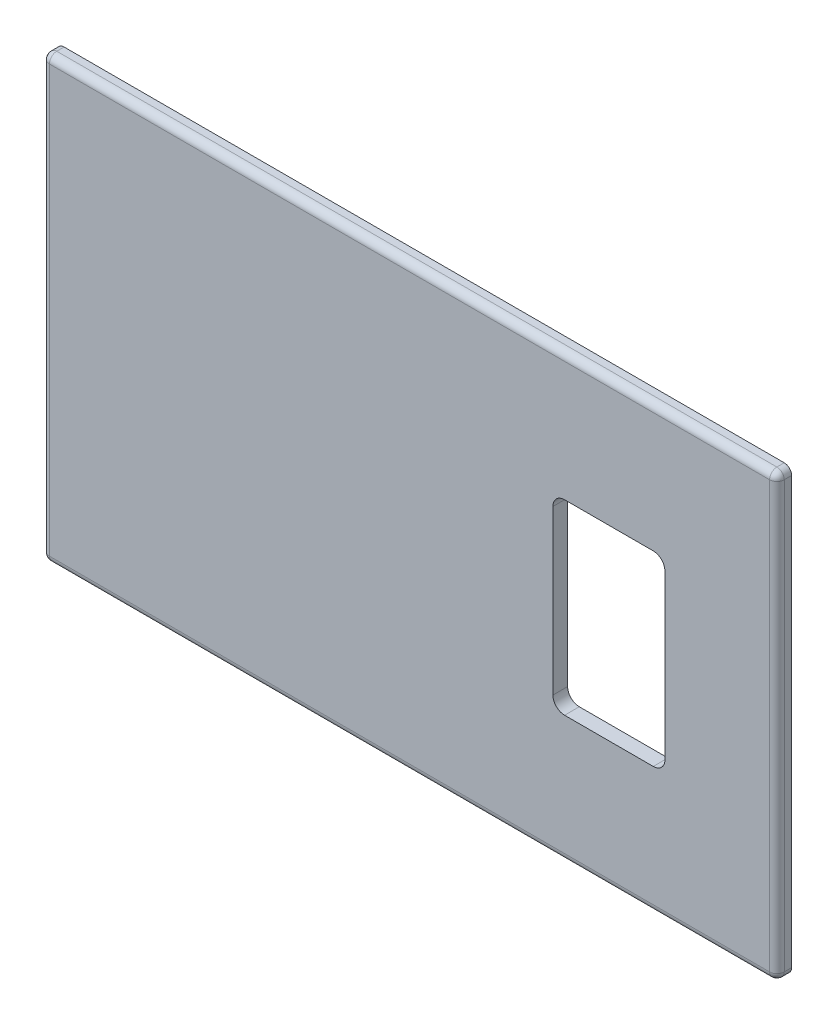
ISO-10303-21;
HEADER;
FILE_DESCRIPTION(('STEP AP214'),'2;1');
FILE_NAME('part.step','',(''),(''),'','','');
FILE_SCHEMA(('AUTOMOTIVE_DESIGN { 1 0 10303 214 1 1 1 1 }'));
ENDSEC;
DATA;
#1=APPLICATION_CONTEXT('core data for automotive mechanical design processes');
#2=APPLICATION_PROTOCOL_DEFINITION('international standard','automotive_design',2000,#1);
#3=PRODUCT_CONTEXT('',#1,'mechanical');
#4=PRODUCT('Part','Part','',(#3));
#5=PRODUCT_RELATED_PRODUCT_CATEGORY('part','',(#4));
#6=PRODUCT_DEFINITION_FORMATION('','',#4);
#7=PRODUCT_DEFINITION_CONTEXT('part definition',#1,'design');
#8=PRODUCT_DEFINITION('design','',#6,#7);
#9=PRODUCT_DEFINITION_SHAPE('','',#8);
#10=(LENGTH_UNIT() NAMED_UNIT(*) SI_UNIT(.MILLI.,.METRE.));
#11=(NAMED_UNIT(*) PLANE_ANGLE_UNIT() SI_UNIT($,.RADIAN.));
#12=(NAMED_UNIT(*) SI_UNIT($,.STERADIAN.) SOLID_ANGLE_UNIT());
#13=UNCERTAINTY_MEASURE_WITH_UNIT(LENGTH_MEASURE(1.E-05),#10,'distance_accuracy_value','');
#14=(GEOMETRIC_REPRESENTATION_CONTEXT(3) GLOBAL_UNCERTAINTY_ASSIGNED_CONTEXT((#13)) GLOBAL_UNIT_ASSIGNED_CONTEXT((#10,
#11,#12)) REPRESENTATION_CONTEXT('',''));
#15=CARTESIAN_POINT('',(0.,0.,0.));
#16=DIRECTION('',(0.,0.,1.));
#17=DIRECTION('',(1.,0.,0.));
#18=AXIS2_PLACEMENT_3D('',#15,#16,#17);
#19=CARTESIAN_POINT('',(-50.,-30.,2.));
#20=DIRECTION('',(0.,1.,0.));
#21=DIRECTION('',(0.,0.,1.));
#22=AXIS2_PLACEMENT_3D('',#19,#20,#21);
#23=PLANE('',#22);
#24=DIRECTION('',(1.,0.,0.));
#25=VECTOR('',#24,1.);
#26=CARTESIAN_POINT('',(-50.,-30.,0.));
#27=LINE('',#26,#25);
#28=CARTESIAN_POINT('',(-49.,-30.,0.));
#29=VERTEX_POINT('',#28);
#30=CARTESIAN_POINT('',(49.,-30.,0.));
#31=VERTEX_POINT('',#30);
#32=EDGE_CURVE('E264',#29,#31,#27,.T.);
#33=ORIENTED_EDGE('',*,*,#32,.T.);
#34=DIRECTION('',(0.,0.,-1.));
#35=VECTOR('',#34,1.);
#36=CARTESIAN_POINT('',(49.,-30.,2.));
#37=LINE('',#36,#35);
#38=CARTESIAN_POINT('',(49.,-30.,1.));
#39=VERTEX_POINT('',#38);
#40=EDGE_CURVE('E211',#31,#39,#37,.F.);
#41=ORIENTED_EDGE('',*,*,#40,.T.);
#42=DIRECTION('',(1.,0.,0.));
#43=VECTOR('',#42,1.);
#44=CARTESIAN_POINT('',(-50.,-30.,1.));
#45=LINE('',#44,#43);
#46=CARTESIAN_POINT('',(-49.,-30.,1.));
#47=VERTEX_POINT('',#46);
#48=EDGE_CURVE('E207',#39,#47,#45,.F.);
#49=ORIENTED_EDGE('',*,*,#48,.T.);
#50=DIRECTION('',(0.,0.,-1.));
#51=VECTOR('',#50,1.);
#52=CARTESIAN_POINT('',(-49.,-30.,0.));
#53=LINE('',#52,#51);
#54=EDGE_CURVE('E209',#47,#29,#53,.T.);
#55=ORIENTED_EDGE('',*,*,#54,.T.);
#56=EDGE_LOOP('',(#33,#41,#49,#55));
#57=FACE_BOUND('',#56,.T.);
#58=ADVANCED_FACE('F39',(#57),#23,.F.);
#59=CARTESIAN_POINT('',(50.,-30.,2.));
#60=DIRECTION('',(-1.,0.,0.));
#61=DIRECTION('',(0.,0.,1.));
#62=AXIS2_PLACEMENT_3D('',#59,#60,#61);
#63=PLANE('',#62);
#64=DIRECTION('',(0.,1.,0.));
#65=VECTOR('',#64,1.);
#66=CARTESIAN_POINT('',(50.,-30.,0.));
#67=LINE('',#66,#65);
#68=CARTESIAN_POINT('',(50.,-29.,0.));
#69=VERTEX_POINT('',#68);
#70=CARTESIAN_POINT('',(50.,29.,0.));
#71=VERTEX_POINT('',#70);
#72=EDGE_CURVE('E184',#69,#71,#67,.T.);
#73=ORIENTED_EDGE('',*,*,#72,.T.);
#74=DIRECTION('',(0.,0.,-1.));
#75=VECTOR('',#74,1.);
#76=CARTESIAN_POINT('',(50.,29.,2.));
#77=LINE('',#76,#75);
#78=CARTESIAN_POINT('',(50.,29.,1.));
#79=VERTEX_POINT('',#78);
#80=EDGE_CURVE('E205',#71,#79,#77,.F.);
#81=ORIENTED_EDGE('',*,*,#80,.T.);
#82=DIRECTION('',(0.,1.,0.));
#83=VECTOR('',#82,1.);
#84=CARTESIAN_POINT('',(50.,-30.,1.));
#85=LINE('',#84,#83);
#86=CARTESIAN_POINT('',(50.,-29.,1.));
#87=VERTEX_POINT('',#86);
#88=EDGE_CURVE('E201',#79,#87,#85,.F.);
#89=ORIENTED_EDGE('',*,*,#88,.T.);
#90=DIRECTION('',(0.,0.,-1.));
#91=VECTOR('',#90,1.);
#92=CARTESIAN_POINT('',(50.,-29.,2.));
#93=LINE('',#92,#91);
#94=EDGE_CURVE('E203',#87,#69,#93,.T.);
#95=ORIENTED_EDGE('',*,*,#94,.T.);
#96=EDGE_LOOP('',(#73,#81,#89,#95));
#97=FACE_BOUND('',#96,.T.);
#98=ADVANCED_FACE('F375',(#97),#63,.F.);
#99=CARTESIAN_POINT('',(-50.,30.,2.));
#100=DIRECTION('',(0.,1.,0.));
#101=DIRECTION('',(0.,0.,1.));
#102=AXIS2_PLACEMENT_3D('',#99,#100,#101);
#103=PLANE('',#102);
#104=DIRECTION('',(1.,0.,0.));
#105=VECTOR('',#104,1.);
#106=CARTESIAN_POINT('',(-50.,30.,1.));
#107=LINE('',#106,#105);
#108=CARTESIAN_POINT('',(-49.,30.,1.));
#109=VERTEX_POINT('',#108);
#110=CARTESIAN_POINT('',(49.,30.,1.));
#111=VERTEX_POINT('',#110);
#112=EDGE_CURVE('E190',#109,#111,#107,.T.);
#113=ORIENTED_EDGE('',*,*,#112,.T.);
#114=DIRECTION('',(0.,0.,-1.));
#115=VECTOR('',#114,1.);
#116=CARTESIAN_POINT('',(49.,30.,0.));
#117=LINE('',#116,#115);
#118=CARTESIAN_POINT('',(49.,30.,0.));
#119=VERTEX_POINT('',#118);
#120=EDGE_CURVE('E176',#111,#119,#117,.T.);
#121=ORIENTED_EDGE('',*,*,#120,.T.);
#122=DIRECTION('',(1.,0.,0.));
#123=VECTOR('',#122,1.);
#124=CARTESIAN_POINT('',(-50.,30.,0.));
#125=LINE('',#124,#123);
#126=CARTESIAN_POINT('',(-49.,30.,0.));
#127=VERTEX_POINT('',#126);
#128=EDGE_CURVE('E169',#127,#119,#125,.T.);
#129=ORIENTED_EDGE('',*,*,#128,.F.);
#130=DIRECTION('',(0.,0.,-1.));
#131=VECTOR('',#130,1.);
#132=CARTESIAN_POINT('',(-49.,30.,2.));
#133=LINE('',#132,#131);
#134=EDGE_CURVE('E181',#127,#109,#133,.F.);
#135=ORIENTED_EDGE('',*,*,#134,.T.);
#136=EDGE_LOOP('',(#113,#121,#129,#135));
#137=FACE_BOUND('',#136,.T.);
#138=ADVANCED_FACE('F180',(#137),#103,.T.);
#139=CARTESIAN_POINT('',(-50.,-30.,2.));
#140=DIRECTION('',(-1.,0.,0.));
#141=DIRECTION('',(0.,0.,1.));
#142=AXIS2_PLACEMENT_3D('',#139,#140,#141);
#143=PLANE('',#142);
#144=DIRECTION('',(0.,1.,0.));
#145=VECTOR('',#144,1.);
#146=CARTESIAN_POINT('',(-50.,-30.,0.));
#147=LINE('',#146,#145);
#148=CARTESIAN_POINT('',(-50.,-29.,0.));
#149=VERTEX_POINT('',#148);
#150=CARTESIAN_POINT('',(-50.,29.,0.));
#151=VERTEX_POINT('',#150);
#152=EDGE_CURVE('E171',#149,#151,#147,.T.);
#153=ORIENTED_EDGE('',*,*,#152,.F.);
#154=DIRECTION('',(0.,0.,-1.));
#155=VECTOR('',#154,1.);
#156=CARTESIAN_POINT('',(-50.,-29.,2.));
#157=LINE('',#156,#155);
#158=CARTESIAN_POINT('',(-50.,-29.,1.));
#159=VERTEX_POINT('',#158);
#160=EDGE_CURVE('E217',#149,#159,#157,.F.);
#161=ORIENTED_EDGE('',*,*,#160,.T.);
#162=DIRECTION('',(0.,1.,0.));
#163=VECTOR('',#162,1.);
#164=CARTESIAN_POINT('',(-50.,-30.,1.));
#165=LINE('',#164,#163);
#166=CARTESIAN_POINT('',(-50.,29.,1.));
#167=VERTEX_POINT('',#166);
#168=EDGE_CURVE('E215',#159,#167,#165,.T.);
#169=ORIENTED_EDGE('',*,*,#168,.T.);
#170=DIRECTION('',(0.,0.,-1.));
#171=VECTOR('',#170,1.);
#172=CARTESIAN_POINT('',(-50.,29.,2.));
#173=LINE('',#172,#171);
#174=EDGE_CURVE('E213',#167,#151,#173,.T.);
#175=ORIENTED_EDGE('',*,*,#174,.T.);
#176=EDGE_LOOP('',(#153,#161,#169,#175));
#177=FACE_BOUND('',#176,.T.);
#178=ADVANCED_FACE('F418',(#177),#143,.T.);
#179=CARTESIAN_POINT('',(0.,0.,2.));
#180=DIRECTION('',(0.,0.,1.));
#181=DIRECTION('',(1.,0.,0.));
#182=AXIS2_PLACEMENT_3D('',#179,#180,#181);
#183=PLANE('',#182);
#184=DIRECTION('',(0.,-1.,0.));
#185=VECTOR('',#184,1.);
#186=CARTESIAN_POINT('',(19.52,12.7,2.));
#187=LINE('',#186,#185);
#188=CARTESIAN_POINT('',(19.52,11.1125,2.));
#189=VERTEX_POINT('',#188);
#190=CARTESIAN_POINT('',(19.52,-11.1125,2.));
#191=VERTEX_POINT('',#190);
#192=EDGE_CURVE('E282',#189,#191,#187,.T.);
#193=ORIENTED_EDGE('',*,*,#192,.F.);
#194=CARTESIAN_POINT('',(21.1075,11.1125,2.));
#195=DIRECTION('',(0.,0.,1.));
#196=DIRECTION('',(1.,0.,0.));
#197=AXIS2_PLACEMENT_3D('',#194,#195,#196);
#198=CIRCLE('',#197,1.5875);
#199=CARTESIAN_POINT('',(21.1075,12.7,2.));
#200=VERTEX_POINT('',#199);
#201=EDGE_CURVE('E302',#189,#200,#198,.F.);
#202=ORIENTED_EDGE('',*,*,#201,.T.);
#203=DIRECTION('',(-1.,0.,0.));
#204=VECTOR('',#203,1.);
#205=CARTESIAN_POINT('',(34.76,12.7,2.));
#206=LINE('',#205,#204);
#207=CARTESIAN_POINT('',(33.1725,12.7,2.));
#208=VERTEX_POINT('',#207);
#209=EDGE_CURVE('E326',#208,#200,#206,.T.);
#210=ORIENTED_EDGE('',*,*,#209,.F.);
#211=CARTESIAN_POINT('',(33.1725,11.1125,2.));
#212=DIRECTION('',(0.,0.,1.));
#213=DIRECTION('',(1.,0.,0.));
#214=AXIS2_PLACEMENT_3D('',#211,#212,#213);
#215=CIRCLE('',#214,1.5875);
#216=CARTESIAN_POINT('',(34.76,11.1125,2.));
#217=VERTEX_POINT('',#216);
#218=EDGE_CURVE('E47',#208,#217,#215,.F.);
#219=ORIENTED_EDGE('',*,*,#218,.T.);
#220=DIRECTION('',(0.,1.,0.));
#221=VECTOR('',#220,1.);
#222=CARTESIAN_POINT('',(34.76,12.7,2.));
#223=LINE('',#222,#221);
#224=CARTESIAN_POINT('',(34.76,-11.1125,2.));
#225=VERTEX_POINT('',#224);
#226=EDGE_CURVE('E293',#225,#217,#223,.T.);
#227=ORIENTED_EDGE('',*,*,#226,.F.);
#228=CARTESIAN_POINT('',(33.1725,-11.1125,2.));
#229=DIRECTION('',(0.,0.,1.));
#230=DIRECTION('',(1.,0.,0.));
#231=AXIS2_PLACEMENT_3D('',#228,#229,#230);
#232=CIRCLE('',#231,1.5875);
#233=CARTESIAN_POINT('',(33.1725,-12.7,2.));
#234=VERTEX_POINT('',#233);
#235=EDGE_CURVE('E312',#225,#234,#232,.F.);
#236=ORIENTED_EDGE('',*,*,#235,.T.);
#237=DIRECTION('',(1.,0.,0.));
#238=VECTOR('',#237,1.);
#239=CARTESIAN_POINT('',(34.76,-12.7,2.));
#240=LINE('',#239,#238);
#241=CARTESIAN_POINT('',(21.1075,-12.7,2.));
#242=VERTEX_POINT('',#241);
#243=EDGE_CURVE('E288',#242,#234,#240,.T.);
#244=ORIENTED_EDGE('',*,*,#243,.F.);
#245=CARTESIAN_POINT('',(21.1075,-11.1125,2.));
#246=DIRECTION('',(0.,0.,1.));
#247=DIRECTION('',(1.,0.,0.));
#248=AXIS2_PLACEMENT_3D('',#245,#246,#247);
#249=CIRCLE('',#248,1.5875);
#250=EDGE_CURVE('E307',#242,#191,#249,.F.);
#251=ORIENTED_EDGE('',*,*,#250,.T.);
#252=EDGE_LOOP('',(#193,#202,#210,#219,#227,#236,#244,#251));
#253=FACE_BOUND('',#252,.T.);
#254=DIRECTION('',(1.,0.,0.));
#255=VECTOR('',#254,1.);
#256=CARTESIAN_POINT('',(0.,29.,2.));
#257=LINE('',#256,#255);
#258=CARTESIAN_POINT('',(49.,29.,2.));
#259=VERTEX_POINT('',#258);
#260=CARTESIAN_POINT('',(-49.,29.,2.));
#261=VERTEX_POINT('',#260);
#262=EDGE_CURVE('E219',#259,#261,#257,.F.);
#263=ORIENTED_EDGE('',*,*,#262,.T.);
#264=DIRECTION('',(0.,1.,0.));
#265=VECTOR('',#264,1.);
#266=CARTESIAN_POINT('',(-49.,0.,2.));
#267=LINE('',#266,#265);
#268=CARTESIAN_POINT('',(-49.,-29.,2.));
#269=VERTEX_POINT('',#268);
#270=EDGE_CURVE('E225',#261,#269,#267,.F.);
#271=ORIENTED_EDGE('',*,*,#270,.T.);
#272=DIRECTION('',(1.,0.,0.));
#273=VECTOR('',#272,1.);
#274=CARTESIAN_POINT('',(50.,-29.,2.));
#275=LINE('',#274,#273);
#276=CARTESIAN_POINT('',(49.,-29.,2.));
#277=VERTEX_POINT('',#276);
#278=EDGE_CURVE('E223',#269,#277,#275,.T.);
#279=ORIENTED_EDGE('',*,*,#278,.T.);
#280=DIRECTION('',(0.,1.,0.));
#281=VECTOR('',#280,1.);
#282=CARTESIAN_POINT('',(49.,30.,2.));
#283=LINE('',#282,#281);
#284=EDGE_CURVE('E221',#277,#259,#283,.T.);
#285=ORIENTED_EDGE('',*,*,#284,.T.);
#286=EDGE_LOOP('',(#263,#271,#279,#285));
#287=FACE_BOUND('',#286,.T.);
#288=ADVANCED_FACE('F323',(#253,#287),#183,.T.);
#289=CARTESIAN_POINT('',(0.,0.,0.));
#290=DIRECTION('',(0.,0.,1.));
#291=DIRECTION('',(1.,0.,0.));
#292=AXIS2_PLACEMENT_3D('',#289,#290,#291);
#293=PLANE('',#292);
#294=DIRECTION('',(0.,1.,0.));
#295=VECTOR('',#294,1.);
#296=CARTESIAN_POINT('',(34.76,12.7,0.));
#297=LINE('',#296,#295);
#298=CARTESIAN_POINT('',(34.76,-11.1125,0.));
#299=VERTEX_POINT('',#298);
#300=CARTESIAN_POINT('',(34.76,11.1125,0.));
#301=VERTEX_POINT('',#300);
#302=EDGE_CURVE('E356',#299,#301,#297,.T.);
#303=ORIENTED_EDGE('',*,*,#302,.T.);
#304=CARTESIAN_POINT('',(33.1725,11.1125,0.));
#305=DIRECTION('',(0.,0.,1.));
#306=DIRECTION('',(1.,0.,0.));
#307=AXIS2_PLACEMENT_3D('',#304,#305,#306);
#308=CIRCLE('',#307,1.5875);
#309=CARTESIAN_POINT('',(33.1725,12.7,0.));
#310=VERTEX_POINT('',#309);
#311=EDGE_CURVE('E12',#301,#310,#308,.T.);
#312=ORIENTED_EDGE('',*,*,#311,.T.);
#313=DIRECTION('',(-1.,0.,0.));
#314=VECTOR('',#313,1.);
#315=CARTESIAN_POINT('',(34.76,12.7,0.));
#316=LINE('',#315,#314);
#317=CARTESIAN_POINT('',(21.1075,12.7,0.));
#318=VERTEX_POINT('',#317);
#319=EDGE_CURVE('E233',#310,#318,#316,.T.);
#320=ORIENTED_EDGE('',*,*,#319,.T.);
#321=CARTESIAN_POINT('',(21.1075,11.1125,0.));
#322=DIRECTION('',(0.,0.,1.));
#323=DIRECTION('',(1.,0.,0.));
#324=AXIS2_PLACEMENT_3D('',#321,#322,#323);
#325=CIRCLE('',#324,1.5875);
#326=CARTESIAN_POINT('',(19.52,11.1125,0.));
#327=VERTEX_POINT('',#326);
#328=EDGE_CURVE('E305',#318,#327,#325,.T.);
#329=ORIENTED_EDGE('',*,*,#328,.T.);
#330=DIRECTION('',(0.,-1.,0.));
#331=VECTOR('',#330,1.);
#332=CARTESIAN_POINT('',(19.52,12.7,0.));
#333=LINE('',#332,#331);
#334=CARTESIAN_POINT('',(19.52,-11.1125,0.));
#335=VERTEX_POINT('',#334);
#336=EDGE_CURVE('E358',#327,#335,#333,.T.);
#337=ORIENTED_EDGE('',*,*,#336,.T.);
#338=CARTESIAN_POINT('',(21.1075,-11.1125,0.));
#339=DIRECTION('',(0.,0.,1.));
#340=DIRECTION('',(1.,0.,0.));
#341=AXIS2_PLACEMENT_3D('',#338,#339,#340);
#342=CIRCLE('',#341,1.5875);
#343=CARTESIAN_POINT('',(21.1075,-12.7,0.));
#344=VERTEX_POINT('',#343);
#345=EDGE_CURVE('E310',#335,#344,#342,.T.);
#346=ORIENTED_EDGE('',*,*,#345,.T.);
#347=DIRECTION('',(1.,0.,0.));
#348=VECTOR('',#347,1.);
#349=CARTESIAN_POINT('',(34.76,-12.7,0.));
#350=LINE('',#349,#348);
#351=CARTESIAN_POINT('',(33.1725,-12.7,0.));
#352=VERTEX_POINT('',#351);
#353=EDGE_CURVE('E357',#344,#352,#350,.T.);
#354=ORIENTED_EDGE('',*,*,#353,.T.);
#355=CARTESIAN_POINT('',(33.1725,-11.1125,0.));
#356=DIRECTION('',(0.,0.,1.));
#357=DIRECTION('',(1.,0.,0.));
#358=AXIS2_PLACEMENT_3D('',#355,#356,#357);
#359=CIRCLE('',#358,1.5875);
#360=EDGE_CURVE('E61',#352,#299,#359,.T.);
#361=ORIENTED_EDGE('',*,*,#360,.T.);
#362=EDGE_LOOP('',(#303,#312,#320,#329,#337,#346,#354,#361));
#363=FACE_BOUND('',#362,.T.);
#364=ORIENTED_EDGE('',*,*,#128,.T.);
#365=CARTESIAN_POINT('',(49.,29.,0.));
#366=DIRECTION('',(0.,0.,1.));
#367=DIRECTION('',(1.,0.,0.));
#368=AXIS2_PLACEMENT_3D('',#365,#366,#367);
#369=CIRCLE('',#368,1.);
#370=EDGE_CURVE('E199',#119,#71,#369,.F.);
#371=ORIENTED_EDGE('',*,*,#370,.T.);
#372=ORIENTED_EDGE('',*,*,#72,.F.);
#373=CARTESIAN_POINT('',(49.,-29.,0.));
#374=DIRECTION('',(0.,0.,1.));
#375=DIRECTION('',(1.,0.,0.));
#376=AXIS2_PLACEMENT_3D('',#373,#374,#375);
#377=CIRCLE('',#376,1.);
#378=EDGE_CURVE('E197',#69,#31,#377,.F.);
#379=ORIENTED_EDGE('',*,*,#378,.T.);
#380=ORIENTED_EDGE('',*,*,#32,.F.);
#381=CARTESIAN_POINT('',(-49.,-29.,0.));
#382=DIRECTION('',(0.,0.,1.));
#383=DIRECTION('',(1.,0.,0.));
#384=AXIS2_PLACEMENT_3D('',#381,#382,#383);
#385=CIRCLE('',#384,1.);
#386=EDGE_CURVE('E175',#29,#149,#385,.F.);
#387=ORIENTED_EDGE('',*,*,#386,.T.);
#388=ORIENTED_EDGE('',*,*,#152,.T.);
#389=CARTESIAN_POINT('',(-49.,29.,0.));
#390=DIRECTION('',(0.,0.,1.));
#391=DIRECTION('',(1.,0.,0.));
#392=AXIS2_PLACEMENT_3D('',#389,#390,#391);
#393=CIRCLE('',#392,1.);
#394=EDGE_CURVE('E166',#151,#127,#393,.F.);
#395=ORIENTED_EDGE('',*,*,#394,.T.);
#396=EDGE_LOOP('',(#364,#371,#372,#379,#380,#387,#388,#395));
#397=FACE_BOUND('',#396,.T.);
#398=ADVANCED_FACE('F168',(#363,#397),#293,.F.);
#399=CARTESIAN_POINT('',(-49.,-29.,2.));
#400=DIRECTION('',(0.,0.,1.));
#401=DIRECTION('',(1.,0.,0.));
#402=AXIS2_PLACEMENT_3D('',#399,#400,#401);
#403=CYLINDRICAL_SURFACE('',#402,1.);
#404=CARTESIAN_POINT('',(-49.,-29.,1.));
#405=DIRECTION('',(0.,0.,1.));
#406=DIRECTION('',(1.,0.,0.));
#407=AXIS2_PLACEMENT_3D('',#404,#405,#406);
#408=CIRCLE('',#407,1.);
#409=EDGE_CURVE('E261',#159,#47,#408,.T.);
#410=ORIENTED_EDGE('',*,*,#409,.F.);
#411=ORIENTED_EDGE('',*,*,#160,.F.);
#412=ORIENTED_EDGE('',*,*,#386,.F.);
#413=ORIENTED_EDGE('',*,*,#54,.F.);
#414=EDGE_LOOP('',(#410,#411,#412,#413));
#415=FACE_BOUND('',#414,.T.);
#416=ADVANCED_FACE('F407',(#415),#403,.T.);
#417=CARTESIAN_POINT('',(-49.,-29.,1.));
#418=DIRECTION('',(0.,0.,1.));
#419=DIRECTION('',(1.,0.,0.));
#420=AXIS2_PLACEMENT_3D('',#417,#418,#419);
#421=SPHERICAL_SURFACE('',#420,1.);
#422=CARTESIAN_POINT('',(-49.,-29.,1.));
#423=DIRECTION('',(0.,-1.,0.));
#424=DIRECTION('',(0.,0.,-1.));
#425=AXIS2_PLACEMENT_3D('',#422,#423,#424);
#426=CIRCLE('',#425,1.);
#427=EDGE_CURVE('E255',#159,#269,#426,.F.);
#428=ORIENTED_EDGE('',*,*,#427,.F.);
#429=ORIENTED_EDGE('',*,*,#409,.T.);
#430=CARTESIAN_POINT('',(-49.,-29.,1.));
#431=DIRECTION('',(-1.,0.,0.));
#432=DIRECTION('',(0.,0.,1.));
#433=AXIS2_PLACEMENT_3D('',#430,#431,#432);
#434=CIRCLE('',#433,1.);
#435=EDGE_CURVE('E258',#269,#47,#434,.F.);
#436=ORIENTED_EDGE('',*,*,#435,.F.);
#437=EDGE_LOOP('',(#428,#429,#436));
#438=FACE_BOUND('',#437,.T.);
#439=ADVANCED_FACE('F411',(#438),#421,.T.);
#440=CARTESIAN_POINT('',(49.,-29.,2.));
#441=DIRECTION('',(0.,0.,-1.));
#442=DIRECTION('',(-1.,0.,0.));
#443=AXIS2_PLACEMENT_3D('',#440,#441,#442);
#444=CYLINDRICAL_SURFACE('',#443,1.);
#445=ORIENTED_EDGE('',*,*,#378,.F.);
#446=ORIENTED_EDGE('',*,*,#94,.F.);
#447=CARTESIAN_POINT('',(49.,-29.,1.));
#448=DIRECTION('',(0.,0.,1.));
#449=DIRECTION('',(1.,0.,0.));
#450=AXIS2_PLACEMENT_3D('',#447,#448,#449);
#451=CIRCLE('',#450,1.);
#452=EDGE_CURVE('E252',#39,#87,#451,.T.);
#453=ORIENTED_EDGE('',*,*,#452,.F.);
#454=ORIENTED_EDGE('',*,*,#40,.F.);
#455=EDGE_LOOP('',(#445,#446,#453,#454));
#456=FACE_BOUND('',#455,.T.);
#457=ADVANCED_FACE('F392',(#456),#444,.T.);
#458=CARTESIAN_POINT('',(0.,-29.,1.));
#459=DIRECTION('',(-1.,0.,0.));
#460=DIRECTION('',(0.,0.,1.));
#461=AXIS2_PLACEMENT_3D('',#458,#459,#460);
#462=CYLINDRICAL_SURFACE('',#461,1.);
#463=ORIENTED_EDGE('',*,*,#435,.T.);
#464=ORIENTED_EDGE('',*,*,#48,.F.);
#465=CARTESIAN_POINT('',(49.,-29.,1.));
#466=DIRECTION('',(1.,0.,0.));
#467=DIRECTION('',(0.,0.,-1.));
#468=AXIS2_PLACEMENT_3D('',#465,#466,#467);
#469=CIRCLE('',#468,1.);
#470=EDGE_CURVE('E249',#277,#39,#469,.T.);
#471=ORIENTED_EDGE('',*,*,#470,.F.);
#472=ORIENTED_EDGE('',*,*,#278,.F.);
#473=EDGE_LOOP('',(#463,#464,#471,#472));
#474=FACE_BOUND('',#473,.T.);
#475=ADVANCED_FACE('F399',(#474),#462,.T.);
#476=CARTESIAN_POINT('',(-49.,-30.,1.));
#477=DIRECTION('',(0.,1.,0.));
#478=DIRECTION('',(0.,0.,1.));
#479=AXIS2_PLACEMENT_3D('',#476,#477,#478);
#480=CYLINDRICAL_SURFACE('',#479,1.);
#481=ORIENTED_EDGE('',*,*,#427,.T.);
#482=ORIENTED_EDGE('',*,*,#270,.F.);
#483=CARTESIAN_POINT('',(-49.,29.,1.));
#484=DIRECTION('',(0.,1.,0.));
#485=DIRECTION('',(0.,0.,1.));
#486=AXIS2_PLACEMENT_3D('',#483,#484,#485);
#487=CIRCLE('',#486,1.);
#488=EDGE_CURVE('E246',#167,#261,#487,.T.);
#489=ORIENTED_EDGE('',*,*,#488,.F.);
#490=ORIENTED_EDGE('',*,*,#168,.F.);
#491=EDGE_LOOP('',(#481,#482,#489,#490));
#492=FACE_BOUND('',#491,.T.);
#493=ADVANCED_FACE('F416',(#492),#480,.T.);
#494=CARTESIAN_POINT('',(-49.,29.,2.));
#495=DIRECTION('',(0.,0.,-1.));
#496=DIRECTION('',(-1.,0.,0.));
#497=AXIS2_PLACEMENT_3D('',#494,#495,#496);
#498=CYLINDRICAL_SURFACE('',#497,1.);
#499=ORIENTED_EDGE('',*,*,#394,.F.);
#500=ORIENTED_EDGE('',*,*,#174,.F.);
#501=CARTESIAN_POINT('',(-49.,29.,1.));
#502=DIRECTION('',(0.,0.,1.));
#503=DIRECTION('',(1.,0.,0.));
#504=AXIS2_PLACEMENT_3D('',#501,#502,#503);
#505=CIRCLE('',#504,1.);
#506=EDGE_CURVE('E188',#109,#167,#505,.T.);
#507=ORIENTED_EDGE('',*,*,#506,.F.);
#508=ORIENTED_EDGE('',*,*,#134,.F.);
#509=EDGE_LOOP('',(#499,#500,#507,#508));
#510=FACE_BOUND('',#509,.T.);
#511=ADVANCED_FACE('F186',(#510),#498,.T.);
#512=CARTESIAN_POINT('',(49.,-29.,1.));
#513=DIRECTION('',(0.,0.,1.));
#514=DIRECTION('',(1.,0.,0.));
#515=AXIS2_PLACEMENT_3D('',#512,#513,#514);
#516=SPHERICAL_SURFACE('',#515,1.);
#517=ORIENTED_EDGE('',*,*,#470,.T.);
#518=ORIENTED_EDGE('',*,*,#452,.T.);
#519=CARTESIAN_POINT('',(49.,-29.,1.));
#520=DIRECTION('',(0.,-1.,0.));
#521=DIRECTION('',(0.,0.,-1.));
#522=AXIS2_PLACEMENT_3D('',#519,#520,#521);
#523=CIRCLE('',#522,1.);
#524=EDGE_CURVE('E242',#277,#87,#523,.F.);
#525=ORIENTED_EDGE('',*,*,#524,.F.);
#526=EDGE_LOOP('',(#517,#518,#525));
#527=FACE_BOUND('',#526,.T.);
#528=ADVANCED_FACE('F395',(#527),#516,.T.);
#529=CARTESIAN_POINT('',(-49.,29.,1.));
#530=DIRECTION('',(0.,0.,1.));
#531=DIRECTION('',(1.,0.,0.));
#532=AXIS2_PLACEMENT_3D('',#529,#530,#531);
#533=SPHERICAL_SURFACE('',#532,1.);
#534=ORIENTED_EDGE('',*,*,#506,.T.);
#535=ORIENTED_EDGE('',*,*,#488,.T.);
#536=CARTESIAN_POINT('',(-49.,29.,1.));
#537=DIRECTION('',(-1.,0.,0.));
#538=DIRECTION('',(0.,0.,1.));
#539=AXIS2_PLACEMENT_3D('',#536,#537,#538);
#540=CIRCLE('',#539,1.);
#541=EDGE_CURVE('E239',#109,#261,#540,.F.);
#542=ORIENTED_EDGE('',*,*,#541,.F.);
#543=EDGE_LOOP('',(#534,#535,#542));
#544=FACE_BOUND('',#543,.T.);
#545=ADVANCED_FACE('F445',(#544),#533,.T.);
#546=CARTESIAN_POINT('',(49.,0.,1.));
#547=DIRECTION('',(0.,-1.,0.));
#548=DIRECTION('',(0.,0.,-1.));
#549=AXIS2_PLACEMENT_3D('',#546,#547,#548);
#550=CYLINDRICAL_SURFACE('',#549,1.);
#551=ORIENTED_EDGE('',*,*,#524,.T.);
#552=ORIENTED_EDGE('',*,*,#88,.F.);
#553=CARTESIAN_POINT('',(49.,29.,1.));
#554=DIRECTION('',(0.,1.,0.));
#555=DIRECTION('',(0.,0.,1.));
#556=AXIS2_PLACEMENT_3D('',#553,#554,#555);
#557=CIRCLE('',#556,1.);
#558=EDGE_CURVE('E236',#259,#79,#557,.T.);
#559=ORIENTED_EDGE('',*,*,#558,.F.);
#560=ORIENTED_EDGE('',*,*,#284,.F.);
#561=EDGE_LOOP('',(#551,#552,#559,#560));
#562=FACE_BOUND('',#561,.T.);
#563=ADVANCED_FACE('F388',(#562),#550,.T.);
#564=CARTESIAN_POINT('',(-50.,29.,1.));
#565=DIRECTION('',(1.,0.,0.));
#566=DIRECTION('',(0.,0.,-1.));
#567=AXIS2_PLACEMENT_3D('',#564,#565,#566);
#568=CYLINDRICAL_SURFACE('',#567,1.);
#569=ORIENTED_EDGE('',*,*,#541,.T.);
#570=ORIENTED_EDGE('',*,*,#262,.F.);
#571=CARTESIAN_POINT('',(49.,29.,1.));
#572=DIRECTION('',(1.,0.,0.));
#573=DIRECTION('',(0.,0.,-1.));
#574=AXIS2_PLACEMENT_3D('',#571,#572,#573);
#575=CIRCLE('',#574,1.);
#576=EDGE_CURVE('E232',#111,#259,#575,.T.);
#577=ORIENTED_EDGE('',*,*,#576,.F.);
#578=ORIENTED_EDGE('',*,*,#112,.F.);
#579=EDGE_LOOP('',(#569,#570,#577,#578));
#580=FACE_BOUND('',#579,.T.);
#581=ADVANCED_FACE('F439',(#580),#568,.T.);
#582=CARTESIAN_POINT('',(49.,29.,1.));
#583=DIRECTION('',(0.,0.,1.));
#584=DIRECTION('',(1.,0.,0.));
#585=AXIS2_PLACEMENT_3D('',#582,#583,#584);
#586=SPHERICAL_SURFACE('',#585,1.);
#587=ORIENTED_EDGE('',*,*,#576,.T.);
#588=ORIENTED_EDGE('',*,*,#558,.T.);
#589=CARTESIAN_POINT('',(49.,29.,1.));
#590=DIRECTION('',(0.,0.,1.));
#591=DIRECTION('',(1.,0.,0.));
#592=AXIS2_PLACEMENT_3D('',#589,#590,#591);
#593=CIRCLE('',#592,1.);
#594=EDGE_CURVE('E229',#111,#79,#593,.F.);
#595=ORIENTED_EDGE('',*,*,#594,.F.);
#596=EDGE_LOOP('',(#587,#588,#595));
#597=FACE_BOUND('',#596,.T.);
#598=ADVANCED_FACE('F383',(#597),#586,.T.);
#599=CARTESIAN_POINT('',(49.,29.,2.));
#600=DIRECTION('',(0.,0.,1.));
#601=DIRECTION('',(1.,0.,0.));
#602=AXIS2_PLACEMENT_3D('',#599,#600,#601);
#603=CYLINDRICAL_SURFACE('',#602,1.);
#604=ORIENTED_EDGE('',*,*,#594,.T.);
#605=ORIENTED_EDGE('',*,*,#80,.F.);
#606=ORIENTED_EDGE('',*,*,#370,.F.);
#607=ORIENTED_EDGE('',*,*,#120,.F.);
#608=EDGE_LOOP('',(#604,#605,#606,#607));
#609=FACE_BOUND('',#608,.T.);
#610=ADVANCED_FACE('F380',(#609),#603,.T.);
#611=CARTESIAN_POINT('',(19.52,12.7,0.));
#612=DIRECTION('',(-1.,0.,0.));
#613=DIRECTION('',(0.,0.,1.));
#614=AXIS2_PLACEMENT_3D('',#611,#612,#613);
#615=PLANE('',#614);
#616=ORIENTED_EDGE('',*,*,#336,.F.);
#617=DIRECTION('',(0.,0.,1.));
#618=VECTOR('',#617,1.);
#619=CARTESIAN_POINT('',(19.52,11.1125,2.));
#620=LINE('',#619,#618);
#621=EDGE_CURVE('E267',#327,#189,#620,.T.);
#622=ORIENTED_EDGE('',*,*,#621,.T.);
#623=ORIENTED_EDGE('',*,*,#192,.T.);
#624=DIRECTION('',(0.,0.,1.));
#625=VECTOR('',#624,1.);
#626=CARTESIAN_POINT('',(19.52,-11.1125,0.));
#627=LINE('',#626,#625);
#628=EDGE_CURVE('E228',#191,#335,#627,.F.);
#629=ORIENTED_EDGE('',*,*,#628,.T.);
#630=EDGE_LOOP('',(#616,#622,#623,#629));
#631=FACE_BOUND('',#630,.T.);
#632=ADVANCED_FACE('F436',(#631),#615,.F.);
#633=CARTESIAN_POINT('',(34.76,12.7,0.));
#634=DIRECTION('',(0.,1.,0.));
#635=DIRECTION('',(-1.,0.,0.));
#636=AXIS2_PLACEMENT_3D('',#633,#634,#635);
#637=PLANE('',#636);
#638=ORIENTED_EDGE('',*,*,#209,.T.);
#639=DIRECTION('',(0.,0.,1.));
#640=VECTOR('',#639,1.);
#641=CARTESIAN_POINT('',(21.1075,12.7,0.));
#642=LINE('',#641,#640);
#643=EDGE_CURVE('E345',#200,#318,#642,.F.);
#644=ORIENTED_EDGE('',*,*,#643,.T.);
#645=ORIENTED_EDGE('',*,*,#319,.F.);
#646=DIRECTION('',(0.,0.,1.));
#647=VECTOR('',#646,1.);
#648=CARTESIAN_POINT('',(33.1725,12.7,2.));
#649=LINE('',#648,#647);
#650=EDGE_CURVE('E272',#310,#208,#649,.T.);
#651=ORIENTED_EDGE('',*,*,#650,.T.);
#652=EDGE_LOOP('',(#638,#644,#645,#651));
#653=FACE_BOUND('',#652,.T.);
#654=ADVANCED_FACE('F354',(#653),#637,.F.);
#655=CARTESIAN_POINT('',(34.76,12.7,0.));
#656=DIRECTION('',(1.,0.,0.));
#657=DIRECTION('',(0.,1.,0.));
#658=AXIS2_PLACEMENT_3D('',#655,#656,#657);
#659=PLANE('',#658);
#660=ORIENTED_EDGE('',*,*,#302,.F.);
#661=DIRECTION('',(0.,0.,1.));
#662=VECTOR('',#661,1.);
#663=CARTESIAN_POINT('',(34.76,-11.1125,2.));
#664=LINE('',#663,#662);
#665=EDGE_CURVE('E296',#299,#225,#664,.T.);
#666=ORIENTED_EDGE('',*,*,#665,.T.);
#667=ORIENTED_EDGE('',*,*,#226,.T.);
#668=DIRECTION('',(0.,0.,1.));
#669=VECTOR('',#668,1.);
#670=CARTESIAN_POINT('',(34.76,11.1125,0.));
#671=LINE('',#670,#669);
#672=EDGE_CURVE('E54',#217,#301,#671,.F.);
#673=ORIENTED_EDGE('',*,*,#672,.T.);
#674=EDGE_LOOP('',(#660,#666,#667,#673));
#675=FACE_BOUND('',#674,.T.);
#676=ADVANCED_FACE('F330',(#675),#659,.F.);
#677=CARTESIAN_POINT('',(34.76,-12.7,0.));
#678=DIRECTION('',(0.,-1.,0.));
#679=DIRECTION('',(1.,0.,0.));
#680=AXIS2_PLACEMENT_3D('',#677,#678,#679);
#681=PLANE('',#680);
#682=ORIENTED_EDGE('',*,*,#353,.F.);
#683=DIRECTION('',(0.,0.,1.));
#684=VECTOR('',#683,1.);
#685=CARTESIAN_POINT('',(21.1075,-12.7,2.));
#686=LINE('',#685,#684);
#687=EDGE_CURVE('E333',#344,#242,#686,.T.);
#688=ORIENTED_EDGE('',*,*,#687,.T.);
#689=ORIENTED_EDGE('',*,*,#243,.T.);
#690=DIRECTION('',(0.,0.,1.));
#691=VECTOR('',#690,1.);
#692=CARTESIAN_POINT('',(33.1725,-12.7,0.));
#693=LINE('',#692,#691);
#694=EDGE_CURVE('E338',#234,#352,#693,.F.);
#695=ORIENTED_EDGE('',*,*,#694,.T.);
#696=EDGE_LOOP('',(#682,#688,#689,#695));
#697=FACE_BOUND('',#696,.T.);
#698=ADVANCED_FACE('F467',(#697),#681,.F.);
#699=CARTESIAN_POINT('',(21.1075,11.1125,0.));
#700=DIRECTION('',(0.,0.,-1.));
#701=DIRECTION('',(-1.,0.,0.));
#702=AXIS2_PLACEMENT_3D('',#699,#700,#701);
#703=CYLINDRICAL_SURFACE('',#702,1.5875);
#704=ORIENTED_EDGE('',*,*,#328,.F.);
#705=ORIENTED_EDGE('',*,*,#643,.F.);
#706=ORIENTED_EDGE('',*,*,#201,.F.);
#707=ORIENTED_EDGE('',*,*,#621,.F.);
#708=EDGE_LOOP('',(#704,#705,#706,#707));
#709=FACE_BOUND('',#708,.T.);
#710=ADVANCED_FACE('F463',(#709),#703,.F.);
#711=CARTESIAN_POINT('',(21.1075,-11.1125,0.));
#712=DIRECTION('',(0.,0.,-1.));
#713=DIRECTION('',(-1.,0.,0.));
#714=AXIS2_PLACEMENT_3D('',#711,#712,#713);
#715=CYLINDRICAL_SURFACE('',#714,1.5875);
#716=ORIENTED_EDGE('',*,*,#345,.F.);
#717=ORIENTED_EDGE('',*,*,#628,.F.);
#718=ORIENTED_EDGE('',*,*,#250,.F.);
#719=ORIENTED_EDGE('',*,*,#687,.F.);
#720=EDGE_LOOP('',(#716,#717,#718,#719));
#721=FACE_BOUND('',#720,.T.);
#722=ADVANCED_FACE('F466',(#721),#715,.F.);
#723=CARTESIAN_POINT('',(33.1725,-11.1125,0.));
#724=DIRECTION('',(0.,0.,-1.));
#725=DIRECTION('',(-1.,0.,0.));
#726=AXIS2_PLACEMENT_3D('',#723,#724,#725);
#727=CYLINDRICAL_SURFACE('',#726,1.5875);
#728=ORIENTED_EDGE('',*,*,#360,.F.);
#729=ORIENTED_EDGE('',*,*,#694,.F.);
#730=ORIENTED_EDGE('',*,*,#235,.F.);
#731=ORIENTED_EDGE('',*,*,#665,.F.);
#732=EDGE_LOOP('',(#728,#729,#730,#731));
#733=FACE_BOUND('',#732,.T.);
#734=ADVANCED_FACE('F470',(#733),#727,.F.);
#735=CARTESIAN_POINT('',(33.1725,11.1125,0.));
#736=DIRECTION('',(0.,0.,-1.));
#737=DIRECTION('',(-1.,0.,0.));
#738=AXIS2_PLACEMENT_3D('',#735,#736,#737);
#739=CYLINDRICAL_SURFACE('',#738,1.5875);
#740=ORIENTED_EDGE('',*,*,#311,.F.);
#741=ORIENTED_EDGE('',*,*,#672,.F.);
#742=ORIENTED_EDGE('',*,*,#218,.F.);
#743=ORIENTED_EDGE('',*,*,#650,.F.);
#744=EDGE_LOOP('',(#740,#741,#742,#743));
#745=FACE_BOUND('',#744,.T.);
#746=ADVANCED_FACE('F41',(#745),#739,.F.);
#747=CLOSED_SHELL('',(#58,#98,#138,#178,#288,#398,#416,#439,#457,#475,#493,#511,#528,#545,#563,
#581,#598,#610,#632,#654,#676,#698,#710,#722,#734,#746));
#748=MANIFOLD_SOLID_BREP('B2',#747);
#749=ADVANCED_BREP_SHAPE_REPRESENTATION('',(#18,#748),#14);
#750=SHAPE_DEFINITION_REPRESENTATION(#9,#749);
ENDSEC;
END-ISO-10303-21;
